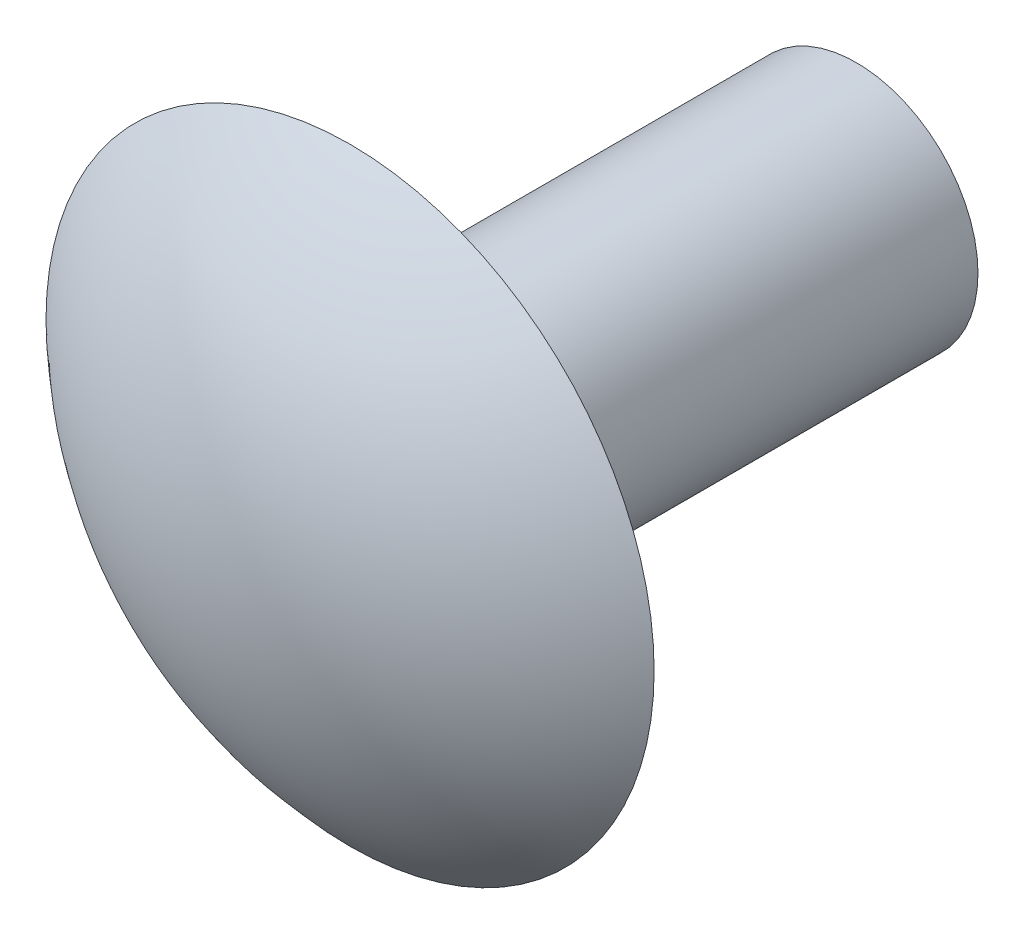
ISO-10303-21;
HEADER;
FILE_DESCRIPTION(('STEP AP214'),'2;1');
FILE_NAME('part.step','',(''),(''),'','','');
FILE_SCHEMA(('AUTOMOTIVE_DESIGN { 1 0 10303 214 1 1 1 1 }'));
ENDSEC;
DATA;
#1=APPLICATION_CONTEXT('core data for automotive mechanical design processes');
#2=APPLICATION_PROTOCOL_DEFINITION('international standard','automotive_design',2000,#1);
#3=PRODUCT_CONTEXT('',#1,'mechanical');
#4=PRODUCT('Part','Part','',(#3));
#5=PRODUCT_RELATED_PRODUCT_CATEGORY('part','',(#4));
#6=PRODUCT_DEFINITION_FORMATION('','',#4);
#7=PRODUCT_DEFINITION_CONTEXT('part definition',#1,'design');
#8=PRODUCT_DEFINITION('design','',#6,#7);
#9=PRODUCT_DEFINITION_SHAPE('','',#8);
#10=(LENGTH_UNIT() NAMED_UNIT(*) SI_UNIT(.MILLI.,.METRE.));
#11=(NAMED_UNIT(*) PLANE_ANGLE_UNIT() SI_UNIT($,.RADIAN.));
#12=(NAMED_UNIT(*) SI_UNIT($,.STERADIAN.) SOLID_ANGLE_UNIT());
#13=UNCERTAINTY_MEASURE_WITH_UNIT(LENGTH_MEASURE(1.E-05),#10,'distance_accuracy_value','');
#14=(GEOMETRIC_REPRESENTATION_CONTEXT(3) GLOBAL_UNCERTAINTY_ASSIGNED_CONTEXT((#13)) GLOBAL_UNIT_ASSIGNED_CONTEXT((#10,
#11,#12)) REPRESENTATION_CONTEXT('',''));
#15=CARTESIAN_POINT('',(0.,0.,0.));
#16=DIRECTION('',(0.,0.,1.));
#17=DIRECTION('',(1.,0.,0.));
#18=AXIS2_PLACEMENT_3D('',#15,#16,#17);
#19=CARTESIAN_POINT('',(0.,0.,0.));
#20=DIRECTION('',(0.,0.,1.));
#21=DIRECTION('',(1.,0.,0.));
#22=AXIS2_PLACEMENT_3D('',#19,#20,#21);
#23=PLANE('',#22);
#24=CARTESIAN_POINT('',(0.,0.,0.));
#25=DIRECTION('',(0.,0.,1.));
#26=DIRECTION('',(1.,0.,0.));
#27=AXIS2_PLACEMENT_3D('',#24,#25,#26);
#28=CIRCLE('',#27,4.7625);
#29=CARTESIAN_POINT('',(4.7625,0.,0.));
#30=VERTEX_POINT('',#29);
#31=EDGE_CURVE('E58',#30,#30,#28,.T.);
#32=ORIENTED_EDGE('',*,*,#31,.T.);
#33=EDGE_LOOP('',(#32));
#34=FACE_BOUND('',#33,.T.);
#35=CARTESIAN_POINT('',(0.,0.,0.));
#36=DIRECTION('',(0.,0.,-1.));
#37=DIRECTION('',(-1.,0.,0.));
#38=AXIS2_PLACEMENT_3D('',#35,#36,#37);
#39=CIRCLE('',#38,11.8999);
#40=CARTESIAN_POINT('',(-11.8999,0.,0.));
#41=VERTEX_POINT('',#40);
#42=EDGE_CURVE('E49',#41,#41,#39,.T.);
#43=ORIENTED_EDGE('',*,*,#42,.T.);
#44=EDGE_LOOP('',(#43));
#45=FACE_BOUND('',#44,.T.);
#46=ADVANCED_FACE('F43',(#34,#45),#23,.F.);
#47=CARTESIAN_POINT('',(0.,0.,-12.5221995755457));
#48=DIRECTION('',(0.,0.,-1.));
#49=DIRECTION('',(-1.,0.,0.));
#50=AXIS2_PLACEMENT_3D('',#47,#48,#49);
#51=DEGENERATE_TOROIDAL_SURFACE('',#50,0.00382914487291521,17.272,.T.);
#52=ORIENTED_EDGE('',*,*,#42,.F.);
#53=EDGE_LOOP('',(#52));
#54=FACE_BOUND('',#53,.T.);
#55=CARTESIAN_POINT('',(0.,0.,4.7498));
#56=DIRECTION('',(0.,0.,-1.));
#57=DIRECTION('',(-1.,0.,0.));
#58=AXIS2_PLACEMENT_3D('',#55,#56,#57);
#59=CIRCLE('',#58,0.00382914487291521);
#60=CARTESIAN_POINT('',(-0.00382914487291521,0.,4.7498));
#61=VERTEX_POINT('',#60);
#62=EDGE_CURVE('E10',#61,#61,#59,.F.);
#63=ORIENTED_EDGE('',*,*,#62,.F.);
#64=EDGE_LOOP('',(#63));
#65=FACE_BOUND('',#64,.T.);
#66=ADVANCED_FACE('F81',(#54,#65),#51,.T.);
#67=CARTESIAN_POINT('',(0.,0.,4.7498));
#68=DIRECTION('',(0.,0.,1.));
#69=DIRECTION('',(1.,0.,0.));
#70=AXIS2_PLACEMENT_3D('',#67,#68,#69);
#71=PLANE('',#70);
#72=ORIENTED_EDGE('',*,*,#62,.T.);
#73=EDGE_LOOP('',(#72));
#74=FACE_BOUND('',#73,.T.);
#75=ADVANCED_FACE('F72',(#74),#71,.T.);
#76=CARTESIAN_POINT('',(0.,0.,-19.812));
#77=DIRECTION('',(0.,0.,1.));
#78=DIRECTION('',(1.,0.,0.));
#79=AXIS2_PLACEMENT_3D('',#76,#77,#78);
#80=CYLINDRICAL_SURFACE('',#79,4.7625);
#81=CARTESIAN_POINT('',(0.,0.,-19.812));
#82=DIRECTION('',(0.,0.,1.));
#83=DIRECTION('',(1.,0.,0.));
#84=AXIS2_PLACEMENT_3D('',#81,#82,#83);
#85=CIRCLE('',#84,4.7625);
#86=CARTESIAN_POINT('',(4.7625,0.,-19.812));
#87=VERTEX_POINT('',#86);
#88=EDGE_CURVE('E54',#87,#87,#85,.T.);
#89=ORIENTED_EDGE('',*,*,#88,.T.);
#90=EDGE_LOOP('',(#89));
#91=FACE_BOUND('',#90,.T.);
#92=ORIENTED_EDGE('',*,*,#31,.F.);
#93=EDGE_LOOP('',(#92));
#94=FACE_BOUND('',#93,.T.);
#95=ADVANCED_FACE('F69',(#91,#94),#80,.T.);
#96=CARTESIAN_POINT('',(0.,0.,-19.812));
#97=DIRECTION('',(0.,0.,1.));
#98=DIRECTION('',(1.,0.,0.));
#99=AXIS2_PLACEMENT_3D('',#96,#97,#98);
#100=PLANE('',#99);
#101=ORIENTED_EDGE('',*,*,#88,.F.);
#102=EDGE_LOOP('',(#101));
#103=FACE_BOUND('',#102,.T.);
#104=ADVANCED_FACE('F70',(#103),#100,.F.);
#105=CLOSED_SHELL('',(#46,#66,#75,#95,#104));
#106=MANIFOLD_SOLID_BREP('B2',#105);
#107=ADVANCED_BREP_SHAPE_REPRESENTATION('',(#18,#106),#14);
#108=SHAPE_DEFINITION_REPRESENTATION(#9,#107);
ENDSEC;
END-ISO-10303-21;
